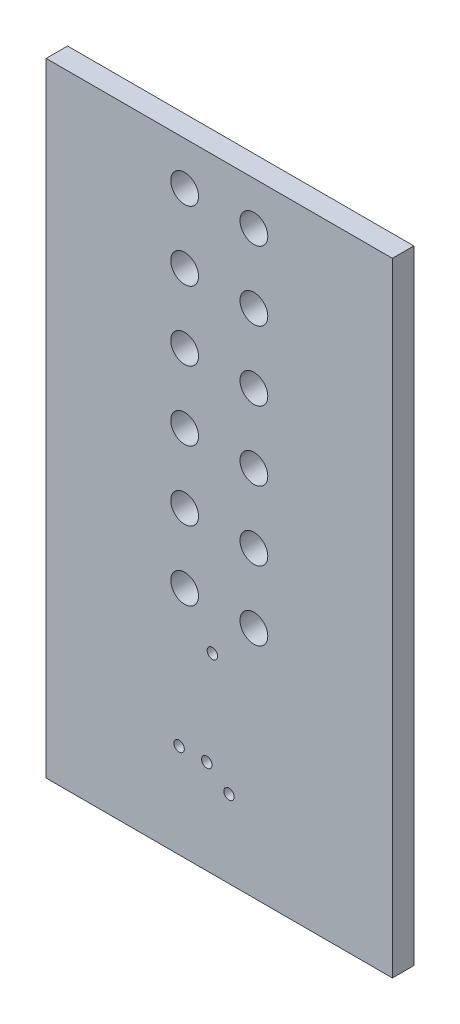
ISO-10303-21;
HEADER;
FILE_DESCRIPTION(('STEP AP214'),'2;1');
FILE_NAME('part.step','',(''),(''),'','','');
FILE_SCHEMA(('AUTOMOTIVE_DESIGN { 1 0 10303 214 1 1 1 1 }'));
ENDSEC;
DATA;
#1=APPLICATION_CONTEXT('core data for automotive mechanical design processes');
#2=APPLICATION_PROTOCOL_DEFINITION('international standard','automotive_design',2000,#1);
#3=PRODUCT_CONTEXT('',#1,'mechanical');
#4=PRODUCT('Part','Part','',(#3));
#5=PRODUCT_RELATED_PRODUCT_CATEGORY('part','',(#4));
#6=PRODUCT_DEFINITION_FORMATION('','',#4);
#7=PRODUCT_DEFINITION_CONTEXT('part definition',#1,'design');
#8=PRODUCT_DEFINITION('design','',#6,#7);
#9=PRODUCT_DEFINITION_SHAPE('','',#8);
#10=(LENGTH_UNIT() NAMED_UNIT(*) SI_UNIT(.MILLI.,.METRE.));
#11=(NAMED_UNIT(*) PLANE_ANGLE_UNIT() SI_UNIT($,.RADIAN.));
#12=(NAMED_UNIT(*) SI_UNIT($,.STERADIAN.) SOLID_ANGLE_UNIT());
#13=UNCERTAINTY_MEASURE_WITH_UNIT(LENGTH_MEASURE(1.E-05),#10,'distance_accuracy_value','');
#14=(GEOMETRIC_REPRESENTATION_CONTEXT(3) GLOBAL_UNCERTAINTY_ASSIGNED_CONTEXT((#13)) GLOBAL_UNIT_ASSIGNED_CONTEXT((#10,
#11,#12)) REPRESENTATION_CONTEXT('',''));
#15=CARTESIAN_POINT('',(0.,0.,0.));
#16=DIRECTION('',(0.,0.,1.));
#17=DIRECTION('',(1.,0.,0.));
#18=AXIS2_PLACEMENT_3D('',#15,#16,#17);
#19=CARTESIAN_POINT('',(12.7,0.,0.7874));
#20=DIRECTION('',(0.,1.,0.));
#21=DIRECTION('',(0.,0.,1.));
#22=AXIS2_PLACEMENT_3D('',#19,#20,#21);
#23=PLANE('',#22);
#24=DIRECTION('',(1.,0.,0.));
#25=VECTOR('',#24,1.);
#26=CARTESIAN_POINT('',(12.7,0.,0.));
#27=LINE('',#26,#25);
#28=CARTESIAN_POINT('',(0.,0.,0.));
#29=VERTEX_POINT('',#28);
#30=CARTESIAN_POINT('',(12.7,0.,0.));
#31=VERTEX_POINT('',#30);
#32=EDGE_CURVE('E101',#29,#31,#27,.T.);
#33=ORIENTED_EDGE('',*,*,#32,.T.);
#34=DIRECTION('',(0.,0.,-1.));
#35=VECTOR('',#34,1.);
#36=CARTESIAN_POINT('',(12.7,0.,0.7874));
#37=LINE('',#36,#35);
#38=CARTESIAN_POINT('',(12.7,0.,0.7874));
#39=VERTEX_POINT('',#38);
#40=EDGE_CURVE('E11',#39,#31,#37,.T.);
#41=ORIENTED_EDGE('',*,*,#40,.F.);
#42=DIRECTION('',(1.,0.,0.));
#43=VECTOR('',#42,1.);
#44=CARTESIAN_POINT('',(12.7,0.,0.7874));
#45=LINE('',#44,#43);
#46=CARTESIAN_POINT('',(0.,0.,0.7874));
#47=VERTEX_POINT('',#46);
#48=EDGE_CURVE('E89',#47,#39,#45,.T.);
#49=ORIENTED_EDGE('',*,*,#48,.F.);
#50=DIRECTION('',(0.,0.,-1.));
#51=VECTOR('',#50,1.);
#52=CARTESIAN_POINT('',(0.,0.,0.7874));
#53=LINE('',#52,#51);
#54=EDGE_CURVE('E97',#47,#29,#53,.T.);
#55=ORIENTED_EDGE('',*,*,#54,.T.);
#56=EDGE_LOOP('',(#33,#41,#49,#55));
#57=FACE_BOUND('',#56,.T.);
#58=ADVANCED_FACE('F38',(#57),#23,.F.);
#59=CARTESIAN_POINT('',(12.7,22.86,0.7874));
#60=DIRECTION('',(-1.,0.,0.));
#61=DIRECTION('',(0.,0.,1.));
#62=AXIS2_PLACEMENT_3D('',#59,#60,#61);
#63=PLANE('',#62);
#64=DIRECTION('',(0.,1.,0.));
#65=VECTOR('',#64,1.);
#66=CARTESIAN_POINT('',(12.7,22.86,0.));
#67=LINE('',#66,#65);
#68=CARTESIAN_POINT('',(12.7,22.86,0.));
#69=VERTEX_POINT('',#68);
#70=EDGE_CURVE('E93',#31,#69,#67,.T.);
#71=ORIENTED_EDGE('',*,*,#70,.T.);
#72=DIRECTION('',(0.,0.,-1.));
#73=VECTOR('',#72,1.);
#74=CARTESIAN_POINT('',(12.7,22.86,0.7874));
#75=LINE('',#74,#73);
#76=CARTESIAN_POINT('',(12.7,22.86,0.7874));
#77=VERTEX_POINT('',#76);
#78=EDGE_CURVE('E46',#77,#69,#75,.T.);
#79=ORIENTED_EDGE('',*,*,#78,.F.);
#80=DIRECTION('',(0.,1.,0.));
#81=VECTOR('',#80,1.);
#82=CARTESIAN_POINT('',(12.7,22.86,0.7874));
#83=LINE('',#82,#81);
#84=EDGE_CURVE('E84',#39,#77,#83,.T.);
#85=ORIENTED_EDGE('',*,*,#84,.F.);
#86=ORIENTED_EDGE('',*,*,#40,.T.);
#87=EDGE_LOOP('',(#71,#79,#85,#86));
#88=FACE_BOUND('',#87,.T.);
#89=ADVANCED_FACE('F92',(#88),#63,.F.);
#90=CARTESIAN_POINT('',(0.,22.86,0.7874));
#91=DIRECTION('',(0.,-1.,0.));
#92=DIRECTION('',(0.,0.,-1.));
#93=AXIS2_PLACEMENT_3D('',#90,#91,#92);
#94=PLANE('',#93);
#95=DIRECTION('',(-1.,0.,0.));
#96=VECTOR('',#95,1.);
#97=CARTESIAN_POINT('',(0.,22.86,0.));
#98=LINE('',#97,#96);
#99=CARTESIAN_POINT('',(0.,22.86,0.));
#100=VERTEX_POINT('',#99);
#101=EDGE_CURVE('E71',#69,#100,#98,.T.);
#102=ORIENTED_EDGE('',*,*,#101,.T.);
#103=DIRECTION('',(0.,0.,-1.));
#104=VECTOR('',#103,1.);
#105=CARTESIAN_POINT('',(0.,22.86,0.7874));
#106=LINE('',#105,#104);
#107=CARTESIAN_POINT('',(0.,22.86,0.7874));
#108=VERTEX_POINT('',#107);
#109=EDGE_CURVE('E94',#108,#100,#106,.T.);
#110=ORIENTED_EDGE('',*,*,#109,.F.);
#111=DIRECTION('',(-1.,0.,0.));
#112=VECTOR('',#111,1.);
#113=CARTESIAN_POINT('',(0.,22.86,0.7874));
#114=LINE('',#113,#112);
#115=EDGE_CURVE('E87',#77,#108,#114,.T.);
#116=ORIENTED_EDGE('',*,*,#115,.F.);
#117=ORIENTED_EDGE('',*,*,#78,.T.);
#118=EDGE_LOOP('',(#102,#110,#116,#117));
#119=FACE_BOUND('',#118,.T.);
#120=ADVANCED_FACE('F95',(#119),#94,.F.);
#121=CARTESIAN_POINT('',(0.,0.,0.7874));
#122=DIRECTION('',(1.,0.,0.));
#123=DIRECTION('',(0.,0.,-1.));
#124=AXIS2_PLACEMENT_3D('',#121,#122,#123);
#125=PLANE('',#124);
#126=DIRECTION('',(0.,-1.,0.));
#127=VECTOR('',#126,1.);
#128=CARTESIAN_POINT('',(0.,0.,0.));
#129=LINE('',#128,#127);
#130=EDGE_CURVE('E77',#100,#29,#129,.T.);
#131=ORIENTED_EDGE('',*,*,#130,.T.);
#132=ORIENTED_EDGE('',*,*,#54,.F.);
#133=DIRECTION('',(0.,-1.,0.));
#134=VECTOR('',#133,1.);
#135=CARTESIAN_POINT('',(0.,0.,0.7874));
#136=LINE('',#135,#134);
#137=EDGE_CURVE('E54',#108,#47,#136,.T.);
#138=ORIENTED_EDGE('',*,*,#137,.F.);
#139=ORIENTED_EDGE('',*,*,#109,.T.);
#140=EDGE_LOOP('',(#131,#132,#138,#139));
#141=FACE_BOUND('',#140,.T.);
#142=ADVANCED_FACE('F109',(#141),#125,.F.);
#143=CARTESIAN_POINT('',(0.,0.,0.7874));
#144=DIRECTION('',(0.,0.,-1.));
#145=DIRECTION('',(-1.,0.,0.));
#146=AXIS2_PLACEMENT_3D('',#143,#144,#145);
#147=PLANE('',#146);
#148=CARTESIAN_POINT('',(7.62,21.27,0.7874));
#149=DIRECTION('',(0.,0.,1.));
#150=DIRECTION('',(1.,0.,0.));
#151=AXIS2_PLACEMENT_3D('',#148,#149,#150);
#152=CIRCLE('',#151,0.51);
#153=CARTESIAN_POINT('',(8.13,21.27,0.7874));
#154=VERTEX_POINT('',#153);
#155=EDGE_CURVE('E150',#154,#154,#152,.T.);
#156=ORIENTED_EDGE('',*,*,#155,.F.);
#157=EDGE_LOOP('',(#156));
#158=FACE_BOUND('',#157,.T.);
#159=CARTESIAN_POINT('',(5.08,8.57,0.7874));
#160=DIRECTION('',(0.,0.,1.));
#161=DIRECTION('',(1.,0.,0.));
#162=AXIS2_PLACEMENT_3D('',#159,#160,#161);
#163=CIRCLE('',#162,0.51);
#164=CARTESIAN_POINT('',(5.59,8.57,0.7874));
#165=VERTEX_POINT('',#164);
#166=EDGE_CURVE('E173',#165,#165,#163,.T.);
#167=ORIENTED_EDGE('',*,*,#166,.F.);
#168=EDGE_LOOP('',(#167));
#169=FACE_BOUND('',#168,.T.);
#170=CARTESIAN_POINT('',(5.08,11.11,0.7874));
#171=DIRECTION('',(0.,0.,1.));
#172=DIRECTION('',(1.,0.,0.));
#173=AXIS2_PLACEMENT_3D('',#170,#171,#172);
#174=CIRCLE('',#173,0.51);
#175=CARTESIAN_POINT('',(5.59,11.11,0.7874));
#176=VERTEX_POINT('',#175);
#177=EDGE_CURVE('E174',#176,#176,#174,.T.);
#178=ORIENTED_EDGE('',*,*,#177,.F.);
#179=EDGE_LOOP('',(#178));
#180=FACE_BOUND('',#179,.T.);
#181=CARTESIAN_POINT('',(5.08,13.65,0.7874));
#182=DIRECTION('',(0.,0.,1.));
#183=DIRECTION('',(1.,0.,0.));
#184=AXIS2_PLACEMENT_3D('',#181,#182,#183);
#185=CIRCLE('',#184,0.51);
#186=CARTESIAN_POINT('',(5.59,13.65,0.7874));
#187=VERTEX_POINT('',#186);
#188=EDGE_CURVE('E185',#187,#187,#185,.T.);
#189=ORIENTED_EDGE('',*,*,#188,.F.);
#190=EDGE_LOOP('',(#189));
#191=FACE_BOUND('',#190,.T.);
#192=CARTESIAN_POINT('',(7.62,18.73,0.7874));
#193=DIRECTION('',(0.,0.,1.));
#194=DIRECTION('',(1.,0.,0.));
#195=AXIS2_PLACEMENT_3D('',#192,#193,#194);
#196=CIRCLE('',#195,0.51);
#197=CARTESIAN_POINT('',(8.13,18.73,0.7874));
#198=VERTEX_POINT('',#197);
#199=EDGE_CURVE('E149',#198,#198,#196,.T.);
#200=ORIENTED_EDGE('',*,*,#199,.F.);
#201=EDGE_LOOP('',(#200));
#202=FACE_BOUND('',#201,.T.);
#203=CARTESIAN_POINT('',(7.62,16.19,0.7874));
#204=DIRECTION('',(0.,0.,1.));
#205=DIRECTION('',(1.,0.,0.));
#206=AXIS2_PLACEMENT_3D('',#203,#204,#205);
#207=CIRCLE('',#206,0.51);
#208=CARTESIAN_POINT('',(8.13,16.19,0.7874));
#209=VERTEX_POINT('',#208);
#210=EDGE_CURVE('E156',#209,#209,#207,.T.);
#211=ORIENTED_EDGE('',*,*,#210,.F.);
#212=EDGE_LOOP('',(#211));
#213=FACE_BOUND('',#212,.T.);
#214=CARTESIAN_POINT('',(7.62,13.65,0.7874));
#215=DIRECTION('',(0.,0.,1.));
#216=DIRECTION('',(1.,0.,0.));
#217=AXIS2_PLACEMENT_3D('',#214,#215,#216);
#218=CIRCLE('',#217,0.51);
#219=CARTESIAN_POINT('',(8.13,13.65,0.7874));
#220=VERTEX_POINT('',#219);
#221=EDGE_CURVE('E162',#220,#220,#218,.T.);
#222=ORIENTED_EDGE('',*,*,#221,.F.);
#223=EDGE_LOOP('',(#222));
#224=FACE_BOUND('',#223,.T.);
#225=CARTESIAN_POINT('',(7.62,11.11,0.7874));
#226=DIRECTION('',(0.,0.,1.));
#227=DIRECTION('',(1.,0.,0.));
#228=AXIS2_PLACEMENT_3D('',#225,#226,#227);
#229=CIRCLE('',#228,0.51);
#230=CARTESIAN_POINT('',(8.13,11.11,0.7874));
#231=VERTEX_POINT('',#230);
#232=EDGE_CURVE('E143',#231,#231,#229,.T.);
#233=ORIENTED_EDGE('',*,*,#232,.F.);
#234=EDGE_LOOP('',(#233));
#235=FACE_BOUND('',#234,.T.);
#236=CARTESIAN_POINT('',(5.08,16.19,0.7874));
#237=DIRECTION('',(0.,0.,1.));
#238=DIRECTION('',(1.,0.,0.));
#239=AXIS2_PLACEMENT_3D('',#236,#237,#238);
#240=CIRCLE('',#239,0.51);
#241=CARTESIAN_POINT('',(5.59,16.19,0.7874));
#242=VERTEX_POINT('',#241);
#243=EDGE_CURVE('E186',#242,#242,#240,.T.);
#244=ORIENTED_EDGE('',*,*,#243,.F.);
#245=EDGE_LOOP('',(#244));
#246=FACE_BOUND('',#245,.T.);
#247=CARTESIAN_POINT('',(5.08,18.73,0.7874));
#248=DIRECTION('',(0.,0.,1.));
#249=DIRECTION('',(1.,0.,0.));
#250=AXIS2_PLACEMENT_3D('',#247,#248,#249);
#251=CIRCLE('',#250,0.51);
#252=CARTESIAN_POINT('',(5.59,18.73,0.7874));
#253=VERTEX_POINT('',#252);
#254=EDGE_CURVE('E203',#253,#253,#251,.T.);
#255=ORIENTED_EDGE('',*,*,#254,.F.);
#256=EDGE_LOOP('',(#255));
#257=FACE_BOUND('',#256,.T.);
#258=CARTESIAN_POINT('',(5.08,21.27,0.7874));
#259=DIRECTION('',(0.,0.,1.));
#260=DIRECTION('',(1.,0.,0.));
#261=AXIS2_PLACEMENT_3D('',#258,#259,#260);
#262=CIRCLE('',#261,0.51);
#263=CARTESIAN_POINT('',(5.59,21.27,0.7874));
#264=VERTEX_POINT('',#263);
#265=EDGE_CURVE('E197',#264,#264,#262,.T.);
#266=ORIENTED_EDGE('',*,*,#265,.F.);
#267=EDGE_LOOP('',(#266));
#268=FACE_BOUND('',#267,.T.);
#269=CARTESIAN_POINT('',(7.62,8.57,0.7874));
#270=DIRECTION('',(0.,0.,1.));
#271=DIRECTION('',(1.,0.,0.));
#272=AXIS2_PLACEMENT_3D('',#269,#270,#271);
#273=CIRCLE('',#272,0.51);
#274=CARTESIAN_POINT('',(8.13,8.57,0.7874));
#275=VERTEX_POINT('',#274);
#276=EDGE_CURVE('E119',#275,#275,#273,.T.);
#277=ORIENTED_EDGE('',*,*,#276,.F.);
#278=EDGE_LOOP('',(#277));
#279=FACE_BOUND('',#278,.T.);
#280=CARTESIAN_POINT('',(4.8768,3.4544,0.7874));
#281=DIRECTION('',(0.,0.,1.));
#282=DIRECTION('',(1.,0.,0.));
#283=AXIS2_PLACEMENT_3D('',#280,#281,#282);
#284=CIRCLE('',#283,0.1905);
#285=CARTESIAN_POINT('',(5.0673,3.4544,0.7874));
#286=VERTEX_POINT('',#285);
#287=EDGE_CURVE('E104',#286,#286,#284,.T.);
#288=ORIENTED_EDGE('',*,*,#287,.F.);
#289=EDGE_LOOP('',(#288));
#290=FACE_BOUND('',#289,.T.);
#291=CARTESIAN_POINT('',(6.096,7.0104,0.7874));
#292=DIRECTION('',(0.,0.,1.));
#293=DIRECTION('',(1.,0.,0.));
#294=AXIS2_PLACEMENT_3D('',#291,#292,#293);
#295=CIRCLE('',#294,0.1905);
#296=CARTESIAN_POINT('',(6.2865,7.0104,0.7874));
#297=VERTEX_POINT('',#296);
#298=EDGE_CURVE('E132',#297,#297,#295,.T.);
#299=ORIENTED_EDGE('',*,*,#298,.F.);
#300=EDGE_LOOP('',(#299));
#301=FACE_BOUND('',#300,.T.);
#302=CARTESIAN_POINT('',(5.8928,3.4544,0.7874));
#303=DIRECTION('',(0.,0.,1.));
#304=DIRECTION('',(1.,0.,0.));
#305=AXIS2_PLACEMENT_3D('',#302,#303,#304);
#306=CIRCLE('',#305,0.1905);
#307=CARTESIAN_POINT('',(6.0833,3.4544,0.7874));
#308=VERTEX_POINT('',#307);
#309=EDGE_CURVE('E125',#308,#308,#306,.T.);
#310=ORIENTED_EDGE('',*,*,#309,.F.);
#311=EDGE_LOOP('',(#310));
#312=FACE_BOUND('',#311,.T.);
#313=CARTESIAN_POINT('',(6.7056,2.8448,0.7874));
#314=DIRECTION('',(0.,0.,1.));
#315=DIRECTION('',(1.,0.,0.));
#316=AXIS2_PLACEMENT_3D('',#313,#314,#315);
#317=CIRCLE('',#316,0.1905);
#318=CARTESIAN_POINT('',(6.8961,2.8448,0.7874));
#319=VERTEX_POINT('',#318);
#320=EDGE_CURVE('E118',#319,#319,#317,.T.);
#321=ORIENTED_EDGE('',*,*,#320,.F.);
#322=EDGE_LOOP('',(#321));
#323=FACE_BOUND('',#322,.T.);
#324=ORIENTED_EDGE('',*,*,#48,.T.);
#325=ORIENTED_EDGE('',*,*,#84,.T.);
#326=ORIENTED_EDGE('',*,*,#115,.T.);
#327=ORIENTED_EDGE('',*,*,#137,.T.);
#328=EDGE_LOOP('',(#324,#325,#326,#327));
#329=FACE_BOUND('',#328,.T.);
#330=ADVANCED_FACE('F85',(#158,#169,#180,#191,#202,#213,#224,#235,#246,#257,#268,#279,#290,#301,
#312,#323,#329),#147,.F.);
#331=CARTESIAN_POINT('',(0.,0.,0.));
#332=DIRECTION('',(0.,0.,-1.));
#333=DIRECTION('',(-1.,0.,0.));
#334=AXIS2_PLACEMENT_3D('',#331,#332,#333);
#335=PLANE('',#334);
#336=CARTESIAN_POINT('',(7.62,21.27,0.));
#337=DIRECTION('',(0.,0.,1.));
#338=DIRECTION('',(1.,0.,0.));
#339=AXIS2_PLACEMENT_3D('',#336,#337,#338);
#340=CIRCLE('',#339,0.51);
#341=CARTESIAN_POINT('',(8.13,21.27,0.));
#342=VERTEX_POINT('',#341);
#343=EDGE_CURVE('E177',#342,#342,#340,.T.);
#344=ORIENTED_EDGE('',*,*,#343,.T.);
#345=EDGE_LOOP('',(#344));
#346=FACE_BOUND('',#345,.T.);
#347=CARTESIAN_POINT('',(5.08,8.57,0.));
#348=DIRECTION('',(0.,0.,1.));
#349=DIRECTION('',(1.,0.,0.));
#350=AXIS2_PLACEMENT_3D('',#347,#348,#349);
#351=CIRCLE('',#350,0.51);
#352=CARTESIAN_POINT('',(5.59,8.57,0.));
#353=VERTEX_POINT('',#352);
#354=EDGE_CURVE('E170',#353,#353,#351,.T.);
#355=ORIENTED_EDGE('',*,*,#354,.T.);
#356=EDGE_LOOP('',(#355));
#357=FACE_BOUND('',#356,.T.);
#358=CARTESIAN_POINT('',(5.08,11.11,0.));
#359=DIRECTION('',(0.,0.,1.));
#360=DIRECTION('',(1.,0.,0.));
#361=AXIS2_PLACEMENT_3D('',#358,#359,#360);
#362=CIRCLE('',#361,0.51);
#363=CARTESIAN_POINT('',(5.59,11.11,0.));
#364=VERTEX_POINT('',#363);
#365=EDGE_CURVE('E189',#364,#364,#362,.T.);
#366=ORIENTED_EDGE('',*,*,#365,.T.);
#367=EDGE_LOOP('',(#366));
#368=FACE_BOUND('',#367,.T.);
#369=CARTESIAN_POINT('',(5.08,13.65,0.));
#370=DIRECTION('',(0.,0.,1.));
#371=DIRECTION('',(1.,0.,0.));
#372=AXIS2_PLACEMENT_3D('',#369,#370,#371);
#373=CIRCLE('',#372,0.51);
#374=CARTESIAN_POINT('',(5.59,13.65,0.));
#375=VERTEX_POINT('',#374);
#376=EDGE_CURVE('E182',#375,#375,#373,.T.);
#377=ORIENTED_EDGE('',*,*,#376,.T.);
#378=EDGE_LOOP('',(#377));
#379=FACE_BOUND('',#378,.T.);
#380=CARTESIAN_POINT('',(7.62,18.73,0.));
#381=DIRECTION('',(0.,0.,1.));
#382=DIRECTION('',(1.,0.,0.));
#383=AXIS2_PLACEMENT_3D('',#380,#381,#382);
#384=CIRCLE('',#383,0.51);
#385=CARTESIAN_POINT('',(8.13,18.73,0.));
#386=VERTEX_POINT('',#385);
#387=EDGE_CURVE('E146',#386,#386,#384,.T.);
#388=ORIENTED_EDGE('',*,*,#387,.T.);
#389=EDGE_LOOP('',(#388));
#390=FACE_BOUND('',#389,.T.);
#391=CARTESIAN_POINT('',(7.62,16.19,0.));
#392=DIRECTION('',(0.,0.,1.));
#393=DIRECTION('',(1.,0.,0.));
#394=AXIS2_PLACEMENT_3D('',#391,#392,#393);
#395=CIRCLE('',#394,0.51);
#396=CARTESIAN_POINT('',(8.13,16.19,0.));
#397=VERTEX_POINT('',#396);
#398=EDGE_CURVE('E153',#397,#397,#395,.T.);
#399=ORIENTED_EDGE('',*,*,#398,.T.);
#400=EDGE_LOOP('',(#399));
#401=FACE_BOUND('',#400,.T.);
#402=CARTESIAN_POINT('',(7.62,13.65,0.));
#403=DIRECTION('',(0.,0.,1.));
#404=DIRECTION('',(1.,0.,0.));
#405=AXIS2_PLACEMENT_3D('',#402,#403,#404);
#406=CIRCLE('',#405,0.51);
#407=CARTESIAN_POINT('',(8.13,13.65,0.));
#408=VERTEX_POINT('',#407);
#409=EDGE_CURVE('E159',#408,#408,#406,.T.);
#410=ORIENTED_EDGE('',*,*,#409,.T.);
#411=EDGE_LOOP('',(#410));
#412=FACE_BOUND('',#411,.T.);
#413=CARTESIAN_POINT('',(7.62,11.11,0.));
#414=DIRECTION('',(0.,0.,1.));
#415=DIRECTION('',(1.,0.,0.));
#416=AXIS2_PLACEMENT_3D('',#413,#414,#415);
#417=CIRCLE('',#416,0.51);
#418=CARTESIAN_POINT('',(8.13,11.11,0.));
#419=VERTEX_POINT('',#418);
#420=EDGE_CURVE('E165',#419,#419,#417,.T.);
#421=ORIENTED_EDGE('',*,*,#420,.T.);
#422=EDGE_LOOP('',(#421));
#423=FACE_BOUND('',#422,.T.);
#424=CARTESIAN_POINT('',(5.08,16.19,0.));
#425=DIRECTION('',(0.,0.,1.));
#426=DIRECTION('',(1.,0.,0.));
#427=AXIS2_PLACEMENT_3D('',#424,#425,#426);
#428=CIRCLE('',#427,0.51);
#429=CARTESIAN_POINT('',(5.59,16.19,0.));
#430=VERTEX_POINT('',#429);
#431=EDGE_CURVE('E206',#430,#430,#428,.T.);
#432=ORIENTED_EDGE('',*,*,#431,.T.);
#433=EDGE_LOOP('',(#432));
#434=FACE_BOUND('',#433,.T.);
#435=CARTESIAN_POINT('',(5.08,18.73,0.));
#436=DIRECTION('',(0.,0.,1.));
#437=DIRECTION('',(1.,0.,0.));
#438=AXIS2_PLACEMENT_3D('',#435,#436,#437);
#439=CIRCLE('',#438,0.51);
#440=CARTESIAN_POINT('',(5.59,18.73,0.));
#441=VERTEX_POINT('',#440);
#442=EDGE_CURVE('E200',#441,#441,#439,.T.);
#443=ORIENTED_EDGE('',*,*,#442,.T.);
#444=EDGE_LOOP('',(#443));
#445=FACE_BOUND('',#444,.T.);
#446=CARTESIAN_POINT('',(5.08,21.27,0.));
#447=DIRECTION('',(0.,0.,1.));
#448=DIRECTION('',(1.,0.,0.));
#449=AXIS2_PLACEMENT_3D('',#446,#447,#448);
#450=CIRCLE('',#449,0.51);
#451=CARTESIAN_POINT('',(5.59,21.27,0.));
#452=VERTEX_POINT('',#451);
#453=EDGE_CURVE('E194',#452,#452,#450,.T.);
#454=ORIENTED_EDGE('',*,*,#453,.T.);
#455=EDGE_LOOP('',(#454));
#456=FACE_BOUND('',#455,.T.);
#457=CARTESIAN_POINT('',(7.62,8.57,0.));
#458=DIRECTION('',(0.,0.,1.));
#459=DIRECTION('',(1.,0.,0.));
#460=AXIS2_PLACEMENT_3D('',#457,#458,#459);
#461=CIRCLE('',#460,0.51);
#462=CARTESIAN_POINT('',(8.13,8.57,0.));
#463=VERTEX_POINT('',#462);
#464=EDGE_CURVE('E140',#463,#463,#461,.T.);
#465=ORIENTED_EDGE('',*,*,#464,.T.);
#466=EDGE_LOOP('',(#465));
#467=FACE_BOUND('',#466,.T.);
#468=CARTESIAN_POINT('',(4.8768,3.4544,0.));
#469=DIRECTION('',(0.,0.,1.));
#470=DIRECTION('',(1.,0.,0.));
#471=AXIS2_PLACEMENT_3D('',#468,#469,#470);
#472=CIRCLE('',#471,0.1905);
#473=CARTESIAN_POINT('',(5.0673,3.4544,0.));
#474=VERTEX_POINT('',#473);
#475=EDGE_CURVE('E135',#474,#474,#472,.T.);
#476=ORIENTED_EDGE('',*,*,#475,.T.);
#477=EDGE_LOOP('',(#476));
#478=FACE_BOUND('',#477,.T.);
#479=CARTESIAN_POINT('',(6.096,7.0104,0.));
#480=DIRECTION('',(0.,0.,1.));
#481=DIRECTION('',(1.,0.,0.));
#482=AXIS2_PLACEMENT_3D('',#479,#480,#481);
#483=CIRCLE('',#482,0.1905);
#484=CARTESIAN_POINT('',(6.2865,7.0104,0.));
#485=VERTEX_POINT('',#484);
#486=EDGE_CURVE('E128',#485,#485,#483,.T.);
#487=ORIENTED_EDGE('',*,*,#486,.T.);
#488=EDGE_LOOP('',(#487));
#489=FACE_BOUND('',#488,.T.);
#490=CARTESIAN_POINT('',(5.8928,3.4544,0.));
#491=DIRECTION('',(0.,0.,1.));
#492=DIRECTION('',(1.,0.,0.));
#493=AXIS2_PLACEMENT_3D('',#490,#491,#492);
#494=CIRCLE('',#493,0.1905);
#495=CARTESIAN_POINT('',(6.0833,3.4544,0.));
#496=VERTEX_POINT('',#495);
#497=EDGE_CURVE('E122',#496,#496,#494,.T.);
#498=ORIENTED_EDGE('',*,*,#497,.T.);
#499=EDGE_LOOP('',(#498));
#500=FACE_BOUND('',#499,.T.);
#501=CARTESIAN_POINT('',(6.7056,2.8448,0.));
#502=DIRECTION('',(0.,0.,1.));
#503=DIRECTION('',(1.,0.,0.));
#504=AXIS2_PLACEMENT_3D('',#501,#502,#503);
#505=CIRCLE('',#504,0.1905);
#506=CARTESIAN_POINT('',(6.8961,2.8448,0.));
#507=VERTEX_POINT('',#506);
#508=EDGE_CURVE('E115',#507,#507,#505,.T.);
#509=ORIENTED_EDGE('',*,*,#508,.T.);
#510=EDGE_LOOP('',(#509));
#511=FACE_BOUND('',#510,.T.);
#512=ORIENTED_EDGE('',*,*,#32,.F.);
#513=ORIENTED_EDGE('',*,*,#130,.F.);
#514=ORIENTED_EDGE('',*,*,#101,.F.);
#515=ORIENTED_EDGE('',*,*,#70,.F.);
#516=EDGE_LOOP('',(#512,#513,#514,#515));
#517=FACE_BOUND('',#516,.T.);
#518=ADVANCED_FACE('F112',(#346,#357,#368,#379,#390,#401,#412,#423,#434,#445,#456,#467,#478,
#489,#500,#511,#517),#335,.T.);
#519=CARTESIAN_POINT('',(6.7056,2.8448,0.7874));
#520=DIRECTION('',(0.,0.,-1.));
#521=DIRECTION('',(-1.,0.,0.));
#522=AXIS2_PLACEMENT_3D('',#519,#520,#521);
#523=CYLINDRICAL_SURFACE('',#522,0.1905);
#524=ORIENTED_EDGE('',*,*,#320,.T.);
#525=EDGE_LOOP('',(#524));
#526=FACE_BOUND('',#525,.T.);
#527=ORIENTED_EDGE('',*,*,#508,.F.);
#528=EDGE_LOOP('',(#527));
#529=FACE_BOUND('',#528,.T.);
#530=ADVANCED_FACE('F233',(#526,#529),#523,.F.);
#531=CARTESIAN_POINT('',(5.8928,3.4544,0.7874));
#532=DIRECTION('',(0.,0.,-1.));
#533=DIRECTION('',(-1.,0.,0.));
#534=AXIS2_PLACEMENT_3D('',#531,#532,#533);
#535=CYLINDRICAL_SURFACE('',#534,0.1905);
#536=ORIENTED_EDGE('',*,*,#309,.T.);
#537=EDGE_LOOP('',(#536));
#538=FACE_BOUND('',#537,.T.);
#539=ORIENTED_EDGE('',*,*,#497,.F.);
#540=EDGE_LOOP('',(#539));
#541=FACE_BOUND('',#540,.T.);
#542=ADVANCED_FACE('F236',(#538,#541),#535,.F.);
#543=CARTESIAN_POINT('',(6.096,7.0104,0.7874));
#544=DIRECTION('',(0.,0.,-1.));
#545=DIRECTION('',(-1.,0.,0.));
#546=AXIS2_PLACEMENT_3D('',#543,#544,#545);
#547=CYLINDRICAL_SURFACE('',#546,0.1905);
#548=ORIENTED_EDGE('',*,*,#298,.T.);
#549=EDGE_LOOP('',(#548));
#550=FACE_BOUND('',#549,.T.);
#551=ORIENTED_EDGE('',*,*,#486,.F.);
#552=EDGE_LOOP('',(#551));
#553=FACE_BOUND('',#552,.T.);
#554=ADVANCED_FACE('F408',(#550,#553),#547,.F.);
#555=CARTESIAN_POINT('',(4.8768,3.4544,0.7874));
#556=DIRECTION('',(0.,0.,-1.));
#557=DIRECTION('',(-1.,0.,0.));
#558=AXIS2_PLACEMENT_3D('',#555,#556,#557);
#559=CYLINDRICAL_SURFACE('',#558,0.1905);
#560=ORIENTED_EDGE('',*,*,#287,.T.);
#561=EDGE_LOOP('',(#560));
#562=FACE_BOUND('',#561,.T.);
#563=ORIENTED_EDGE('',*,*,#475,.F.);
#564=EDGE_LOOP('',(#563));
#565=FACE_BOUND('',#564,.T.);
#566=ADVANCED_FACE('F274',(#562,#565),#559,.F.);
#567=CARTESIAN_POINT('',(7.62,8.57,0.7874));
#568=DIRECTION('',(0.,0.,-1.));
#569=DIRECTION('',(-1.,0.,0.));
#570=AXIS2_PLACEMENT_3D('',#567,#568,#569);
#571=CYLINDRICAL_SURFACE('',#570,0.51);
#572=ORIENTED_EDGE('',*,*,#276,.T.);
#573=EDGE_LOOP('',(#572));
#574=FACE_BOUND('',#573,.T.);
#575=ORIENTED_EDGE('',*,*,#464,.F.);
#576=EDGE_LOOP('',(#575));
#577=FACE_BOUND('',#576,.T.);
#578=ADVANCED_FACE('F287',(#574,#577),#571,.F.);
#579=CARTESIAN_POINT('',(5.08,21.27,0.7874));
#580=DIRECTION('',(0.,0.,-1.));
#581=DIRECTION('',(-1.,0.,0.));
#582=AXIS2_PLACEMENT_3D('',#579,#580,#581);
#583=CYLINDRICAL_SURFACE('',#582,0.51);
#584=ORIENTED_EDGE('',*,*,#265,.T.);
#585=EDGE_LOOP('',(#584));
#586=FACE_BOUND('',#585,.T.);
#587=ORIENTED_EDGE('',*,*,#453,.F.);
#588=EDGE_LOOP('',(#587));
#589=FACE_BOUND('',#588,.T.);
#590=ADVANCED_FACE('F292',(#586,#589),#583,.F.);
#591=CARTESIAN_POINT('',(5.08,18.73,0.7874));
#592=DIRECTION('',(0.,0.,-1.));
#593=DIRECTION('',(-1.,0.,0.));
#594=AXIS2_PLACEMENT_3D('',#591,#592,#593);
#595=CYLINDRICAL_SURFACE('',#594,0.51);
#596=ORIENTED_EDGE('',*,*,#254,.T.);
#597=EDGE_LOOP('',(#596));
#598=FACE_BOUND('',#597,.T.);
#599=ORIENTED_EDGE('',*,*,#442,.F.);
#600=EDGE_LOOP('',(#599));
#601=FACE_BOUND('',#600,.T.);
#602=ADVANCED_FACE('F303',(#598,#601),#595,.F.);
#603=CARTESIAN_POINT('',(5.08,16.19,0.7874));
#604=DIRECTION('',(0.,0.,-1.));
#605=DIRECTION('',(-1.,0.,0.));
#606=AXIS2_PLACEMENT_3D('',#603,#604,#605);
#607=CYLINDRICAL_SURFACE('',#606,0.51);
#608=ORIENTED_EDGE('',*,*,#243,.T.);
#609=EDGE_LOOP('',(#608));
#610=FACE_BOUND('',#609,.T.);
#611=ORIENTED_EDGE('',*,*,#431,.F.);
#612=EDGE_LOOP('',(#611));
#613=FACE_BOUND('',#612,.T.);
#614=ADVANCED_FACE('F212',(#610,#613),#607,.F.);
#615=CARTESIAN_POINT('',(7.62,11.11,0.7874));
#616=DIRECTION('',(0.,0.,-1.));
#617=DIRECTION('',(-1.,0.,0.));
#618=AXIS2_PLACEMENT_3D('',#615,#616,#617);
#619=CYLINDRICAL_SURFACE('',#618,0.51);
#620=ORIENTED_EDGE('',*,*,#232,.T.);
#621=EDGE_LOOP('',(#620));
#622=FACE_BOUND('',#621,.T.);
#623=ORIENTED_EDGE('',*,*,#420,.F.);
#624=EDGE_LOOP('',(#623));
#625=FACE_BOUND('',#624,.T.);
#626=ADVANCED_FACE('F322',(#622,#625),#619,.F.);
#627=CARTESIAN_POINT('',(7.62,13.65,0.7874));
#628=DIRECTION('',(0.,0.,-1.));
#629=DIRECTION('',(-1.,0.,0.));
#630=AXIS2_PLACEMENT_3D('',#627,#628,#629);
#631=CYLINDRICAL_SURFACE('',#630,0.51);
#632=ORIENTED_EDGE('',*,*,#221,.T.);
#633=EDGE_LOOP('',(#632));
#634=FACE_BOUND('',#633,.T.);
#635=ORIENTED_EDGE('',*,*,#409,.F.);
#636=EDGE_LOOP('',(#635));
#637=FACE_BOUND('',#636,.T.);
#638=ADVANCED_FACE('F331',(#634,#637),#631,.F.);
#639=CARTESIAN_POINT('',(7.62,16.19,0.7874));
#640=DIRECTION('',(0.,0.,-1.));
#641=DIRECTION('',(-1.,0.,0.));
#642=AXIS2_PLACEMENT_3D('',#639,#640,#641);
#643=CYLINDRICAL_SURFACE('',#642,0.51);
#644=ORIENTED_EDGE('',*,*,#210,.T.);
#645=EDGE_LOOP('',(#644));
#646=FACE_BOUND('',#645,.T.);
#647=ORIENTED_EDGE('',*,*,#398,.F.);
#648=EDGE_LOOP('',(#647));
#649=FACE_BOUND('',#648,.T.);
#650=ADVANCED_FACE('F341',(#646,#649),#643,.F.);
#651=CARTESIAN_POINT('',(7.62,18.73,0.7874));
#652=DIRECTION('',(0.,0.,-1.));
#653=DIRECTION('',(-1.,0.,0.));
#654=AXIS2_PLACEMENT_3D('',#651,#652,#653);
#655=CYLINDRICAL_SURFACE('',#654,0.51);
#656=ORIENTED_EDGE('',*,*,#199,.T.);
#657=EDGE_LOOP('',(#656));
#658=FACE_BOUND('',#657,.T.);
#659=ORIENTED_EDGE('',*,*,#387,.F.);
#660=EDGE_LOOP('',(#659));
#661=FACE_BOUND('',#660,.T.);
#662=ADVANCED_FACE('F351',(#658,#661),#655,.F.);
#663=CARTESIAN_POINT('',(5.08,13.65,0.7874));
#664=DIRECTION('',(0.,0.,-1.));
#665=DIRECTION('',(-1.,0.,0.));
#666=AXIS2_PLACEMENT_3D('',#663,#664,#665);
#667=CYLINDRICAL_SURFACE('',#666,0.51);
#668=ORIENTED_EDGE('',*,*,#188,.T.);
#669=EDGE_LOOP('',(#668));
#670=FACE_BOUND('',#669,.T.);
#671=ORIENTED_EDGE('',*,*,#376,.F.);
#672=EDGE_LOOP('',(#671));
#673=FACE_BOUND('',#672,.T.);
#674=ADVANCED_FACE('F361',(#670,#673),#667,.F.);
#675=CARTESIAN_POINT('',(5.08,11.11,0.7874));
#676=DIRECTION('',(0.,0.,-1.));
#677=DIRECTION('',(-1.,0.,0.));
#678=AXIS2_PLACEMENT_3D('',#675,#676,#677);
#679=CYLINDRICAL_SURFACE('',#678,0.51);
#680=ORIENTED_EDGE('',*,*,#177,.T.);
#681=EDGE_LOOP('',(#680));
#682=FACE_BOUND('',#681,.T.);
#683=ORIENTED_EDGE('',*,*,#365,.F.);
#684=EDGE_LOOP('',(#683));
#685=FACE_BOUND('',#684,.T.);
#686=ADVANCED_FACE('F371',(#682,#685),#679,.F.);
#687=CARTESIAN_POINT('',(5.08,8.57,0.7874));
#688=DIRECTION('',(0.,0.,-1.));
#689=DIRECTION('',(-1.,0.,0.));
#690=AXIS2_PLACEMENT_3D('',#687,#688,#689);
#691=CYLINDRICAL_SURFACE('',#690,0.51);
#692=ORIENTED_EDGE('',*,*,#166,.T.);
#693=EDGE_LOOP('',(#692));
#694=FACE_BOUND('',#693,.T.);
#695=ORIENTED_EDGE('',*,*,#354,.F.);
#696=EDGE_LOOP('',(#695));
#697=FACE_BOUND('',#696,.T.);
#698=ADVANCED_FACE('F381',(#694,#697),#691,.F.);
#699=CARTESIAN_POINT('',(7.62,21.27,0.7874));
#700=DIRECTION('',(0.,0.,-1.));
#701=DIRECTION('',(-1.,0.,0.));
#702=AXIS2_PLACEMENT_3D('',#699,#700,#701);
#703=CYLINDRICAL_SURFACE('',#702,0.51);
#704=ORIENTED_EDGE('',*,*,#155,.T.);
#705=EDGE_LOOP('',(#704));
#706=FACE_BOUND('',#705,.T.);
#707=ORIENTED_EDGE('',*,*,#343,.F.);
#708=EDGE_LOOP('',(#707));
#709=FACE_BOUND('',#708,.T.);
#710=ADVANCED_FACE('F391',(#706,#709),#703,.F.);
#711=CLOSED_SHELL('',(#58,#89,#120,#142,#330,#518,#530,#542,#554,#566,#578,#590,#602,#614,#626,
#638,#650,#662,#674,#686,#698,#710));
#712=MANIFOLD_SOLID_BREP('B2',#711);
#713=ADVANCED_BREP_SHAPE_REPRESENTATION('',(#18,#712),#14);
#714=SHAPE_DEFINITION_REPRESENTATION(#9,#713);
ENDSEC;
END-ISO-10303-21;
